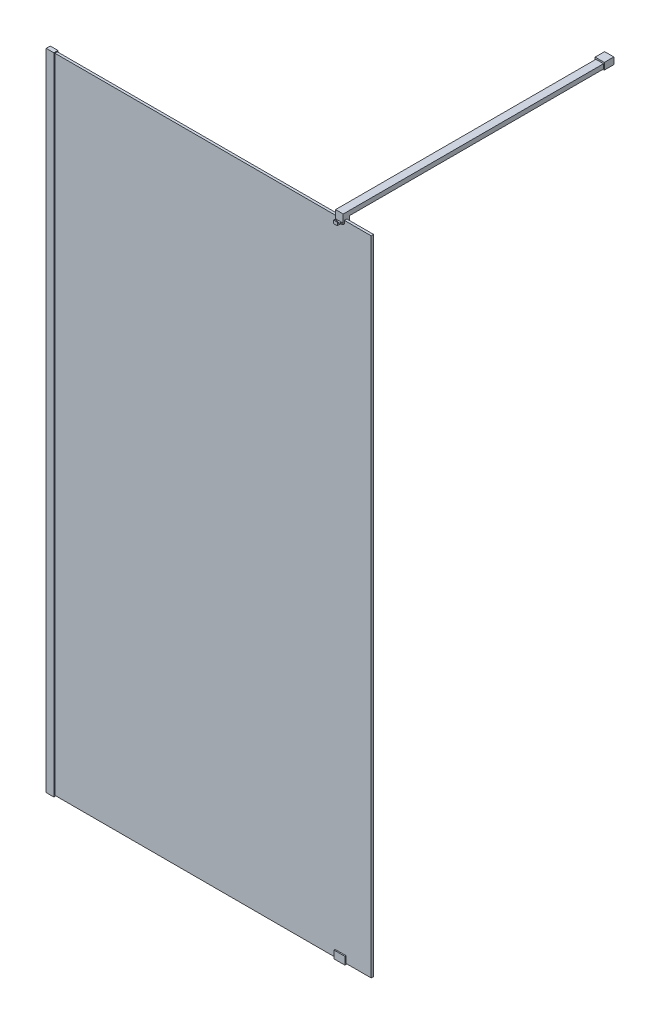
ISO-10303-21;
HEADER;
FILE_DESCRIPTION(('STEP AP214'),'2;1');
FILE_NAME('part.step','',(''),(''),'','','');
FILE_SCHEMA(('AUTOMOTIVE_DESIGN { 1 0 10303 214 1 1 1 1 }'));
ENDSEC;
DATA;
#1=APPLICATION_CONTEXT('core data for automotive mechanical design processes');
#2=APPLICATION_PROTOCOL_DEFINITION('international standard','automotive_design',2000,#1);
#3=PRODUCT_CONTEXT('',#1,'mechanical');
#4=PRODUCT('Part','Part','',(#3));
#5=PRODUCT_RELATED_PRODUCT_CATEGORY('part','',(#4));
#6=PRODUCT_DEFINITION_FORMATION('','',#4);
#7=PRODUCT_DEFINITION_CONTEXT('part definition',#1,'design');
#8=PRODUCT_DEFINITION('design','',#6,#7);
#9=PRODUCT_DEFINITION_SHAPE('','',#8);
#10=(LENGTH_UNIT() NAMED_UNIT(*) SI_UNIT(.MILLI.,.METRE.));
#11=(NAMED_UNIT(*) PLANE_ANGLE_UNIT() SI_UNIT($,.RADIAN.));
#12=(NAMED_UNIT(*) SI_UNIT($,.STERADIAN.) SOLID_ANGLE_UNIT());
#13=UNCERTAINTY_MEASURE_WITH_UNIT(LENGTH_MEASURE(1.E-05),#10,'distance_accuracy_value','');
#14=(GEOMETRIC_REPRESENTATION_CONTEXT(3) GLOBAL_UNCERTAINTY_ASSIGNED_CONTEXT((#13)) GLOBAL_UNIT_ASSIGNED_CONTEXT((#10,
#11,#12)) REPRESENTATION_CONTEXT('',''));
#15=CARTESIAN_POINT('',(0.,0.,0.));
#16=DIRECTION('',(0.,0.,1.));
#17=DIRECTION('',(1.,0.,0.));
#18=AXIS2_PLACEMENT_3D('',#15,#16,#17);
#19=CARTESIAN_POINT('',(970.95,2090.,-19.4000000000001));
#20=DIRECTION('',(-1.,0.,0.));
#21=DIRECTION('',(0.,0.,1.));
#22=AXIS2_PLACEMENT_3D('',#19,#20,#21);
#23=PLANE('',#22);
#24=DIRECTION('',(0.,-1.,0.));
#25=VECTOR('',#24,1.);
#26=CARTESIAN_POINT('',(970.95,2090.,-850.03));
#27=LINE('',#26,#25);
#28=CARTESIAN_POINT('',(970.95,2120.,-850.03));
#29=VERTEX_POINT('',#28);
#30=CARTESIAN_POINT('',(970.95,2105.,-850.03));
#31=VERTEX_POINT('',#30);
#32=EDGE_CURVE('E61',#29,#31,#27,.T.);
#33=ORIENTED_EDGE('',*,*,#32,.F.);
#34=DIRECTION('',(0.,0.,1.));
#35=VECTOR('',#34,1.);
#36=CARTESIAN_POINT('',(970.95,2120.,0.599999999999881));
#37=LINE('',#36,#35);
#38=CARTESIAN_POINT('',(970.95,2120.,0.599999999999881));
#39=VERTEX_POINT('',#38);
#40=EDGE_CURVE('E386',#29,#39,#37,.T.);
#41=ORIENTED_EDGE('',*,*,#40,.T.);
#42=DIRECTION('',(0.,-1.,0.));
#43=VECTOR('',#42,1.);
#44=CARTESIAN_POINT('',(970.95,2094.,0.599999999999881));
#45=LINE('',#44,#43);
#46=CARTESIAN_POINT('',(970.95,2094.,0.599999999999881));
#47=VERTEX_POINT('',#46);
#48=EDGE_CURVE('E388',#39,#47,#45,.T.);
#49=ORIENTED_EDGE('',*,*,#48,.T.);
#50=DIRECTION('',(0.,1.,0.));
#51=VECTOR('',#50,1.);
#52=CARTESIAN_POINT('',(970.95,2090.,0.599999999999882));
#53=LINE('',#52,#51);
#54=CARTESIAN_POINT('',(970.95,2090.,0.599999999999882));
#55=VERTEX_POINT('',#54);
#56=EDGE_CURVE('E332',#55,#47,#53,.T.);
#57=ORIENTED_EDGE('',*,*,#56,.F.);
#58=DIRECTION('',(0.,0.,-1.));
#59=VECTOR('',#58,1.);
#60=CARTESIAN_POINT('',(970.95,2090.,-3.40000000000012));
#61=LINE('',#60,#59);
#62=CARTESIAN_POINT('',(970.95,2090.,-3.40000000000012));
#63=VERTEX_POINT('',#62);
#64=EDGE_CURVE('E362',#55,#63,#61,.T.);
#65=ORIENTED_EDGE('',*,*,#64,.T.);
#66=DIRECTION('',(0.,1.,-1.30407837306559E-13));
#67=VECTOR('',#66,1.);
#68=CARTESIAN_POINT('',(970.95,2100.,-3.40000000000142));
#69=LINE('',#68,#67);
#70=CARTESIAN_POINT('',(970.95,2100.,-3.40000000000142));
#71=VERTEX_POINT('',#70);
#72=EDGE_CURVE('E392',#63,#71,#69,.T.);
#73=ORIENTED_EDGE('',*,*,#72,.T.);
#74=DIRECTION('',(0.,0.,-1.));
#75=VECTOR('',#74,1.);
#76=CARTESIAN_POINT('',(970.95,2100.,-11.4000000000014));
#77=LINE('',#76,#75);
#78=CARTESIAN_POINT('',(970.95,2100.,-11.4000000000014));
#79=VERTEX_POINT('',#78);
#80=EDGE_CURVE('E394',#71,#79,#77,.T.);
#81=ORIENTED_EDGE('',*,*,#80,.T.);
#82=DIRECTION('',(0.,-1.,1.30451205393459E-13));
#83=VECTOR('',#82,1.);
#84=CARTESIAN_POINT('',(970.95,2090.,-11.4000000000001));
#85=LINE('',#84,#83);
#86=CARTESIAN_POINT('',(970.95,2090.,-11.4000000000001));
#87=VERTEX_POINT('',#86);
#88=EDGE_CURVE('E395',#79,#87,#85,.T.);
#89=ORIENTED_EDGE('',*,*,#88,.T.);
#90=DIRECTION('',(0.,0.,-1.));
#91=VECTOR('',#90,1.);
#92=CARTESIAN_POINT('',(970.95,2090.,-19.4000000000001));
#93=LINE('',#92,#91);
#94=CARTESIAN_POINT('',(970.95,2090.,-19.4000000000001));
#95=VERTEX_POINT('',#94);
#96=EDGE_CURVE('E283',#87,#95,#93,.T.);
#97=ORIENTED_EDGE('',*,*,#96,.T.);
#98=DIRECTION('',(0.,1.,0.));
#99=VECTOR('',#98,1.);
#100=CARTESIAN_POINT('',(970.95,2120.,-19.4000000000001));
#101=LINE('',#100,#99);
#102=CARTESIAN_POINT('',(970.95,2105.,-19.4000000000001));
#103=VERTEX_POINT('',#102);
#104=EDGE_CURVE('E249',#95,#103,#101,.T.);
#105=ORIENTED_EDGE('',*,*,#104,.T.);
#106=DIRECTION('',(0.,0.,-1.));
#107=VECTOR('',#106,1.);
#108=CARTESIAN_POINT('',(970.95,2105.,-881.03));
#109=LINE('',#108,#107);
#110=EDGE_CURVE('E248',#103,#31,#109,.T.);
#111=ORIENTED_EDGE('',*,*,#110,.T.);
#112=EDGE_LOOP('',(#33,#41,#49,#57,#65,#73,#81,#89,#97,#105,#111));
#113=FACE_BOUND('',#112,.T.);
#114=ADVANCED_FACE('F46',(#113),#23,.F.);
#115=CARTESIAN_POINT('',(945.95,2090.,-19.4000000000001));
#116=DIRECTION('',(-1.,0.,0.));
#117=DIRECTION('',(0.,0.,1.));
#118=AXIS2_PLACEMENT_3D('',#115,#116,#117);
#119=PLANE('',#118);
#120=DIRECTION('',(0.,0.,1.));
#121=VECTOR('',#120,1.);
#122=CARTESIAN_POINT('',(945.95,2120.,0.599999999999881));
#123=LINE('',#122,#121);
#124=CARTESIAN_POINT('',(945.95,2120.,-850.03));
#125=VERTEX_POINT('',#124);
#126=CARTESIAN_POINT('',(945.95,2120.,0.599999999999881));
#127=VERTEX_POINT('',#126);
#128=EDGE_CURVE('E272',#125,#127,#123,.T.);
#129=ORIENTED_EDGE('',*,*,#128,.F.);
#130=DIRECTION('',(0.,-1.,0.));
#131=VECTOR('',#130,1.);
#132=CARTESIAN_POINT('',(945.95,2090.,-850.03));
#133=LINE('',#132,#131);
#134=CARTESIAN_POINT('',(945.95,2105.,-850.03));
#135=VERTEX_POINT('',#134);
#136=EDGE_CURVE('E230',#125,#135,#133,.T.);
#137=ORIENTED_EDGE('',*,*,#136,.T.);
#138=DIRECTION('',(0.,0.,1.));
#139=VECTOR('',#138,1.);
#140=CARTESIAN_POINT('',(945.95,2105.,-881.03));
#141=LINE('',#140,#139);
#142=CARTESIAN_POINT('',(945.95,2105.,-19.4000000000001));
#143=VERTEX_POINT('',#142);
#144=EDGE_CURVE('E238',#135,#143,#141,.T.);
#145=ORIENTED_EDGE('',*,*,#144,.T.);
#146=DIRECTION('',(0.,1.,0.));
#147=VECTOR('',#146,1.);
#148=CARTESIAN_POINT('',(945.95,2120.,-19.4000000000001));
#149=LINE('',#148,#147);
#150=CARTESIAN_POINT('',(945.95,2090.,-19.4000000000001));
#151=VERTEX_POINT('',#150);
#152=EDGE_CURVE('E262',#151,#143,#149,.T.);
#153=ORIENTED_EDGE('',*,*,#152,.F.);
#154=DIRECTION('',(0.,0.,-1.));
#155=VECTOR('',#154,1.);
#156=CARTESIAN_POINT('',(945.95,2090.,-19.4000000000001));
#157=LINE('',#156,#155);
#158=CARTESIAN_POINT('',(945.95,2090.,-11.4000000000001));
#159=VERTEX_POINT('',#158);
#160=EDGE_CURVE('E296',#159,#151,#157,.T.);
#161=ORIENTED_EDGE('',*,*,#160,.F.);
#162=DIRECTION('',(0.,-1.,1.30451205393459E-13));
#163=VECTOR('',#162,1.);
#164=CARTESIAN_POINT('',(945.95,2090.,-11.4000000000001));
#165=LINE('',#164,#163);
#166=CARTESIAN_POINT('',(945.95,2100.,-11.4000000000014));
#167=VERTEX_POINT('',#166);
#168=EDGE_CURVE('E294',#167,#159,#165,.T.);
#169=ORIENTED_EDGE('',*,*,#168,.F.);
#170=DIRECTION('',(0.,0.,-1.));
#171=VECTOR('',#170,1.);
#172=CARTESIAN_POINT('',(945.95,2100.,-11.4000000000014));
#173=LINE('',#172,#171);
#174=CARTESIAN_POINT('',(945.95,2100.,-3.40000000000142));
#175=VERTEX_POINT('',#174);
#176=EDGE_CURVE('E292',#175,#167,#173,.T.);
#177=ORIENTED_EDGE('',*,*,#176,.F.);
#178=DIRECTION('',(0.,1.,-1.30407837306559E-13));
#179=VECTOR('',#178,1.);
#180=CARTESIAN_POINT('',(945.95,2100.,-3.40000000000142));
#181=LINE('',#180,#179);
#182=CARTESIAN_POINT('',(945.95,2090.,-3.40000000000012));
#183=VERTEX_POINT('',#182);
#184=EDGE_CURVE('E290',#183,#175,#181,.T.);
#185=ORIENTED_EDGE('',*,*,#184,.F.);
#186=DIRECTION('',(0.,0.,-1.));
#187=VECTOR('',#186,1.);
#188=CARTESIAN_POINT('',(945.95,2090.,-3.40000000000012));
#189=LINE('',#188,#187);
#190=CARTESIAN_POINT('',(945.95,2090.,0.599999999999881));
#191=VERTEX_POINT('',#190);
#192=EDGE_CURVE('E288',#191,#183,#189,.T.);
#193=ORIENTED_EDGE('',*,*,#192,.F.);
#194=DIRECTION('',(0.,1.,0.));
#195=VECTOR('',#194,1.);
#196=CARTESIAN_POINT('',(945.95,2090.,0.599999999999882));
#197=LINE('',#196,#195);
#198=CARTESIAN_POINT('',(945.95,2094.,0.599999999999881));
#199=VERTEX_POINT('',#198);
#200=EDGE_CURVE('E329',#191,#199,#197,.T.);
#201=ORIENTED_EDGE('',*,*,#200,.T.);
#202=DIRECTION('',(0.,-1.,0.));
#203=VECTOR('',#202,1.);
#204=CARTESIAN_POINT('',(945.95,2094.,0.599999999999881));
#205=LINE('',#204,#203);
#206=EDGE_CURVE('E274',#127,#199,#205,.T.);
#207=ORIENTED_EDGE('',*,*,#206,.F.);
#208=EDGE_LOOP('',(#129,#137,#145,#153,#161,#169,#177,#185,#193,#201,#207));
#209=FACE_BOUND('',#208,.T.);
#210=ADVANCED_FACE('F259',(#209),#119,.T.);
#211=CARTESIAN_POINT('',(970.95,2120.,0.599999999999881));
#212=DIRECTION('',(0.,-1.,0.));
#213=DIRECTION('',(0.,0.,-1.));
#214=AXIS2_PLACEMENT_3D('',#211,#212,#213);
#215=PLANE('',#214);
#216=DIRECTION('',(1.,0.,0.));
#217=VECTOR('',#216,1.);
#218=CARTESIAN_POINT('',(970.95,2120.,-850.03));
#219=LINE('',#218,#217);
#220=EDGE_CURVE('E68',#125,#29,#219,.T.);
#221=ORIENTED_EDGE('',*,*,#220,.F.);
#222=ORIENTED_EDGE('',*,*,#128,.T.);
#223=DIRECTION('',(-1.,0.,0.));
#224=VECTOR('',#223,1.);
#225=CARTESIAN_POINT('',(970.95,2120.,0.599999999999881));
#226=LINE('',#225,#224);
#227=EDGE_CURVE('E326',#39,#127,#226,.T.);
#228=ORIENTED_EDGE('',*,*,#227,.F.);
#229=ORIENTED_EDGE('',*,*,#40,.F.);
#230=EDGE_LOOP('',(#221,#222,#228,#229));
#231=FACE_BOUND('',#230,.T.);
#232=ADVANCED_FACE('F437',(#231),#215,.F.);
#233=CARTESIAN_POINT('',(945.95,2105.,-19.4000000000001));
#234=DIRECTION('',(0.,1.,0.));
#235=DIRECTION('',(0.,0.,1.));
#236=AXIS2_PLACEMENT_3D('',#233,#234,#235);
#237=PLANE('',#236);
#238=DIRECTION('',(-1.,0.,0.));
#239=VECTOR('',#238,1.);
#240=CARTESIAN_POINT('',(945.95,2105.,-850.03));
#241=LINE('',#240,#239);
#242=EDGE_CURVE('E12',#31,#135,#241,.T.);
#243=ORIENTED_EDGE('',*,*,#242,.F.);
#244=ORIENTED_EDGE('',*,*,#110,.F.);
#245=DIRECTION('',(1.,0.,0.));
#246=VECTOR('',#245,1.);
#247=CARTESIAN_POINT('',(945.95,2105.,-19.4000000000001));
#248=LINE('',#247,#246);
#249=EDGE_CURVE('E244',#143,#103,#248,.T.);
#250=ORIENTED_EDGE('',*,*,#249,.F.);
#251=ORIENTED_EDGE('',*,*,#144,.F.);
#252=EDGE_LOOP('',(#243,#244,#250,#251));
#253=FACE_BOUND('',#252,.T.);
#254=ADVANCED_FACE('F265',(#253),#237,.F.);
#255=CARTESIAN_POINT('',(970.95,2094.,9.84506801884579));
#256=DIRECTION('',(0.,-1.,0.));
#257=DIRECTION('',(0.,0.,-1.));
#258=AXIS2_PLACEMENT_3D('',#255,#256,#257);
#259=PLANE('',#258);
#260=DIRECTION('',(-0.906307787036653,0.,-0.422618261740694));
#261=VECTOR('',#260,1.);
#262=CARTESIAN_POINT('',(970.025911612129,2094.,11.8267819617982));
#263=LINE('',#262,#261);
#264=CARTESIAN_POINT('',(952.45,2094.,3.6309997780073));
#265=VERTEX_POINT('',#264);
#266=EDGE_CURVE('E365',#265,#199,#263,.T.);
#267=ORIENTED_EDGE('',*,*,#266,.F.);
#268=DIRECTION('',(0.,0.,-1.));
#269=VECTOR('',#268,1.);
#270=CARTESIAN_POINT('',(952.45,2094.,9.84506801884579));
#271=LINE('',#270,#269);
#272=CARTESIAN_POINT('',(952.45,2094.,9.84506801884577));
#273=VERTEX_POINT('',#272);
#274=EDGE_CURVE('E273',#273,#265,#271,.T.);
#275=ORIENTED_EDGE('',*,*,#274,.F.);
#276=DIRECTION('',(-1.,0.,0.));
#277=VECTOR('',#276,1.);
#278=CARTESIAN_POINT('',(970.95,2094.,9.84506801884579));
#279=LINE('',#278,#277);
#280=CARTESIAN_POINT('',(964.45,2094.,9.84506801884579));
#281=VERTEX_POINT('',#280);
#282=EDGE_CURVE('E320',#281,#273,#279,.T.);
#283=ORIENTED_EDGE('',*,*,#282,.F.);
#284=DIRECTION('',(0.,0.,1.));
#285=VECTOR('',#284,1.);
#286=CARTESIAN_POINT('',(964.45,2094.,9.84506801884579));
#287=LINE('',#286,#285);
#288=CARTESIAN_POINT('',(964.45,2094.,3.63099977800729));
#289=VERTEX_POINT('',#288);
#290=EDGE_CURVE('E379',#289,#281,#287,.T.);
#291=ORIENTED_EDGE('',*,*,#290,.F.);
#292=DIRECTION('',(-0.906307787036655,0.,0.422618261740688));
#293=VECTOR('',#292,1.);
#294=CARTESIAN_POINT('',(967.408933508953,2094.,2.25122642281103));
#295=LINE('',#294,#293);
#296=EDGE_CURVE('E364',#47,#289,#295,.T.);
#297=ORIENTED_EDGE('',*,*,#296,.F.);
#298=DIRECTION('',(-1.,0.,0.));
#299=VECTOR('',#298,1.);
#300=CARTESIAN_POINT('',(970.95,2094.,0.599999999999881));
#301=LINE('',#300,#299);
#302=EDGE_CURVE('E323',#47,#199,#301,.T.);
#303=ORIENTED_EDGE('',*,*,#302,.T.);
#304=EDGE_LOOP('',(#267,#275,#283,#291,#297,#303));
#305=FACE_BOUND('',#304,.T.);
#306=ADVANCED_FACE('F424',(#305),#259,.F.);
#307=CARTESIAN_POINT('',(970.95,2100.,10.3700000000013));
#308=DIRECTION('',(0.,-0.087155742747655,0.996194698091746));
#309=DIRECTION('',(0.,-0.996194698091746,-0.087155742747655));
#310=AXIS2_PLACEMENT_3D('',#307,#308,#309);
#311=PLANE('',#310);
#312=DIRECTION('',(0.,-0.996194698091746,-0.087155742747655));
#313=VECTOR('',#312,1.);
#314=CARTESIAN_POINT('',(952.45,2100.,10.3700000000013));
#315=LINE('',#314,#313);
#316=CARTESIAN_POINT('',(952.45,2100.,10.3700000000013));
#317=VERTEX_POINT('',#316);
#318=EDGE_CURVE('E276',#317,#273,#315,.T.);
#319=ORIENTED_EDGE('',*,*,#318,.F.);
#320=DIRECTION('',(-1.,0.,0.));
#321=VECTOR('',#320,1.);
#322=CARTESIAN_POINT('',(970.95,2100.,10.3700000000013));
#323=LINE('',#322,#321);
#324=CARTESIAN_POINT('',(964.45,2100.,10.3700000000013));
#325=VERTEX_POINT('',#324);
#326=EDGE_CURVE('E317',#325,#317,#323,.T.);
#327=ORIENTED_EDGE('',*,*,#326,.F.);
#328=DIRECTION('',(0.,0.996194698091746,0.087155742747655));
#329=VECTOR('',#328,1.);
#330=CARTESIAN_POINT('',(964.45,2100.,10.3700000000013));
#331=LINE('',#330,#329);
#332=EDGE_CURVE('E376',#281,#325,#331,.T.);
#333=ORIENTED_EDGE('',*,*,#332,.F.);
#334=ORIENTED_EDGE('',*,*,#282,.T.);
#335=EDGE_LOOP('',(#319,#327,#333,#334));
#336=FACE_BOUND('',#335,.T.);
#337=ADVANCED_FACE('F428',(#336),#311,.F.);
#338=CARTESIAN_POINT('',(970.95,2100.,13.3700000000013));
#339=DIRECTION('',(0.,-1.,1.48029736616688E-13));
#340=DIRECTION('',(0.,-1.48029736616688E-13,-1.));
#341=AXIS2_PLACEMENT_3D('',#338,#339,#340);
#342=PLANE('',#341);
#343=DIRECTION('',(0.,-1.48029736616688E-13,-1.));
#344=VECTOR('',#343,1.);
#345=CARTESIAN_POINT('',(952.45,2100.,13.3700000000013));
#346=LINE('',#345,#344);
#347=CARTESIAN_POINT('',(952.45,2100.,13.3700000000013));
#348=VERTEX_POINT('',#347);
#349=EDGE_CURVE('E382',#348,#317,#346,.T.);
#350=ORIENTED_EDGE('',*,*,#349,.F.);
#351=DIRECTION('',(-1.,0.,0.));
#352=VECTOR('',#351,1.);
#353=CARTESIAN_POINT('',(970.95,2100.,13.3700000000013));
#354=LINE('',#353,#352);
#355=CARTESIAN_POINT('',(964.45,2100.,13.3700000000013));
#356=VERTEX_POINT('',#355);
#357=EDGE_CURVE('E314',#356,#348,#354,.T.);
#358=ORIENTED_EDGE('',*,*,#357,.F.);
#359=DIRECTION('',(0.,1.48029736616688E-13,1.));
#360=VECTOR('',#359,1.);
#361=CARTESIAN_POINT('',(964.45,2100.,13.3700000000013));
#362=LINE('',#361,#360);
#363=EDGE_CURVE('E368',#325,#356,#362,.T.);
#364=ORIENTED_EDGE('',*,*,#363,.F.);
#365=ORIENTED_EDGE('',*,*,#326,.T.);
#366=EDGE_LOOP('',(#350,#358,#364,#365));
#367=FACE_BOUND('',#366,.T.);
#368=ADVANCED_FACE('F431',(#367),#342,.F.);
#369=CARTESIAN_POINT('',(970.95,2090.,13.3700000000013));
#370=DIRECTION('',(0.,0.,-1.));
#371=DIRECTION('',(0.,1.,0.));
#372=AXIS2_PLACEMENT_3D('',#369,#370,#371);
#373=PLANE('',#372);
#374=ORIENTED_EDGE('',*,*,#357,.T.);
#375=DIRECTION('',(0.,-1.,0.));
#376=VECTOR('',#375,1.);
#377=CARTESIAN_POINT('',(952.45,7694.31257189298,13.3700000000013));
#378=LINE('',#377,#376);
#379=CARTESIAN_POINT('',(952.45,2090.,13.3700000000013));
#380=VERTEX_POINT('',#379);
#381=EDGE_CURVE('E345',#348,#380,#378,.T.);
#382=ORIENTED_EDGE('',*,*,#381,.T.);
#383=DIRECTION('',(-1.,0.,0.));
#384=VECTOR('',#383,1.);
#385=CARTESIAN_POINT('',(970.95,2090.,13.3700000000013));
#386=LINE('',#385,#384);
#387=CARTESIAN_POINT('',(964.45,2090.,13.3700000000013));
#388=VERTEX_POINT('',#387);
#389=EDGE_CURVE('E311',#388,#380,#386,.T.);
#390=ORIENTED_EDGE('',*,*,#389,.F.);
#391=DIRECTION('',(0.,-1.,0.));
#392=VECTOR('',#391,1.);
#393=CARTESIAN_POINT('',(964.45,7694.31257189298,13.3700000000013));
#394=LINE('',#393,#392);
#395=EDGE_CURVE('E355',#356,#388,#394,.T.);
#396=ORIENTED_EDGE('',*,*,#395,.F.);
#397=EDGE_LOOP('',(#374,#382,#390,#396));
#398=FACE_BOUND('',#397,.T.);
#399=ADVANCED_FACE('F353',(#398),#373,.F.);
#400=CARTESIAN_POINT('',(970.95,2090.,-3.40000000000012));
#401=DIRECTION('',(0.,1.,0.));
#402=DIRECTION('',(0.,0.,1.));
#403=AXIS2_PLACEMENT_3D('',#400,#401,#402);
#404=PLANE('',#403);
#405=DIRECTION('',(0.906307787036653,0.,0.422618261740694));
#406=VECTOR('',#405,1.);
#407=CARTESIAN_POINT('',(964.952756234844,2090.,9.46113075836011));
#408=LINE('',#407,#406);
#409=CARTESIAN_POINT('',(952.45,2090.,3.6309997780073));
#410=VERTEX_POINT('',#409);
#411=EDGE_CURVE('E370',#191,#410,#408,.T.);
#412=ORIENTED_EDGE('',*,*,#411,.F.);
#413=ORIENTED_EDGE('',*,*,#192,.T.);
#414=DIRECTION('',(-1.,0.,0.));
#415=VECTOR('',#414,1.);
#416=CARTESIAN_POINT('',(970.95,2090.,-3.40000000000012));
#417=LINE('',#416,#415);
#418=EDGE_CURVE('E308',#63,#183,#417,.T.);
#419=ORIENTED_EDGE('',*,*,#418,.F.);
#420=ORIENTED_EDGE('',*,*,#64,.F.);
#421=DIRECTION('',(0.906307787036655,0.,-0.422618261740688));
#422=VECTOR('',#421,1.);
#423=CARTESIAN_POINT('',(972.482088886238,2090.,-0.114424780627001));
#424=LINE('',#423,#422);
#425=CARTESIAN_POINT('',(964.45,2090.,3.6309997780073));
#426=VERTEX_POINT('',#425);
#427=EDGE_CURVE('E360',#426,#55,#424,.T.);
#428=ORIENTED_EDGE('',*,*,#427,.F.);
#429=DIRECTION('',(0.,0.,-1.));
#430=VECTOR('',#429,1.);
#431=CARTESIAN_POINT('',(964.45,2090.,-3.40000000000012));
#432=LINE('',#431,#430);
#433=EDGE_CURVE('E334',#388,#426,#432,.T.);
#434=ORIENTED_EDGE('',*,*,#433,.F.);
#435=ORIENTED_EDGE('',*,*,#389,.T.);
#436=DIRECTION('',(0.,0.,1.));
#437=VECTOR('',#436,1.);
#438=CARTESIAN_POINT('',(952.45,2090.,-3.40000000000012));
#439=LINE('',#438,#437);
#440=EDGE_CURVE('E54',#410,#380,#439,.T.);
#441=ORIENTED_EDGE('',*,*,#440,.F.);
#442=EDGE_LOOP('',(#412,#413,#419,#420,#428,#434,#435,#441));
#443=FACE_BOUND('',#442,.T.);
#444=ADVANCED_FACE('F357',(#443),#404,.F.);
#445=CARTESIAN_POINT('',(970.95,2120.,-19.4000000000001));
#446=DIRECTION('',(0.,0.,1.));
#447=DIRECTION('',(0.,-1.,0.));
#448=AXIS2_PLACEMENT_3D('',#445,#446,#447);
#449=PLANE('',#448);
#450=ORIENTED_EDGE('',*,*,#152,.T.);
#451=ORIENTED_EDGE('',*,*,#249,.T.);
#452=ORIENTED_EDGE('',*,*,#104,.F.);
#453=DIRECTION('',(-1.,0.,0.));
#454=VECTOR('',#453,1.);
#455=CARTESIAN_POINT('',(970.95,2090.,-19.4000000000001));
#456=LINE('',#455,#454);
#457=EDGE_CURVE('E271',#95,#151,#456,.T.);
#458=ORIENTED_EDGE('',*,*,#457,.T.);
#459=EDGE_LOOP('',(#450,#451,#452,#458));
#460=FACE_BOUND('',#459,.T.);
#461=ADVANCED_FACE('F48',(#460),#449,.F.);
#462=CARTESIAN_POINT('',(970.95,2094.,0.599999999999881));
#463=DIRECTION('',(0.,0.,-1.));
#464=DIRECTION('',(0.,1.,0.));
#465=AXIS2_PLACEMENT_3D('',#462,#463,#464);
#466=PLANE('',#465);
#467=ORIENTED_EDGE('',*,*,#206,.T.);
#468=ORIENTED_EDGE('',*,*,#302,.F.);
#469=ORIENTED_EDGE('',*,*,#48,.F.);
#470=ORIENTED_EDGE('',*,*,#227,.T.);
#471=EDGE_LOOP('',(#467,#468,#469,#470));
#472=FACE_BOUND('',#471,.T.);
#473=ADVANCED_FACE('F435',(#472),#466,.F.);
#474=CARTESIAN_POINT('',(970.95,2100.,-3.40000000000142));
#475=DIRECTION('',(0.,1.30407837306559E-13,1.));
#476=DIRECTION('',(0.,-1.,1.30407837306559E-13));
#477=AXIS2_PLACEMENT_3D('',#474,#475,#476);
#478=PLANE('',#477);
#479=ORIENTED_EDGE('',*,*,#184,.T.);
#480=DIRECTION('',(-1.,0.,0.));
#481=VECTOR('',#480,1.);
#482=CARTESIAN_POINT('',(970.95,2100.,-3.40000000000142));
#483=LINE('',#482,#481);
#484=EDGE_CURVE('E305',#71,#175,#483,.T.);
#485=ORIENTED_EDGE('',*,*,#484,.F.);
#486=ORIENTED_EDGE('',*,*,#72,.F.);
#487=ORIENTED_EDGE('',*,*,#418,.T.);
#488=EDGE_LOOP('',(#479,#485,#486,#487));
#489=FACE_BOUND('',#488,.T.);
#490=ADVANCED_FACE('F413',(#489),#478,.F.);
#491=CARTESIAN_POINT('',(970.95,2100.,-11.4000000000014));
#492=DIRECTION('',(0.,1.,0.));
#493=DIRECTION('',(0.,0.,1.));
#494=AXIS2_PLACEMENT_3D('',#491,#492,#493);
#495=PLANE('',#494);
#496=ORIENTED_EDGE('',*,*,#176,.T.);
#497=DIRECTION('',(-1.,0.,0.));
#498=VECTOR('',#497,1.);
#499=CARTESIAN_POINT('',(970.95,2100.,-11.4000000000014));
#500=LINE('',#499,#498);
#501=EDGE_CURVE('E302',#79,#167,#500,.T.);
#502=ORIENTED_EDGE('',*,*,#501,.F.);
#503=ORIENTED_EDGE('',*,*,#80,.F.);
#504=ORIENTED_EDGE('',*,*,#484,.T.);
#505=EDGE_LOOP('',(#496,#502,#503,#504));
#506=FACE_BOUND('',#505,.T.);
#507=ADVANCED_FACE('F409',(#506),#495,.F.);
#508=CARTESIAN_POINT('',(970.95,2090.,-11.4000000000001));
#509=DIRECTION('',(0.,-1.30451205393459E-13,-1.));
#510=DIRECTION('',(0.,1.,-1.30451205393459E-13));
#511=AXIS2_PLACEMENT_3D('',#508,#509,#510);
#512=PLANE('',#511);
#513=ORIENTED_EDGE('',*,*,#168,.T.);
#514=DIRECTION('',(-1.,0.,0.));
#515=VECTOR('',#514,1.);
#516=CARTESIAN_POINT('',(970.95,2090.,-11.4000000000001));
#517=LINE('',#516,#515);
#518=EDGE_CURVE('E299',#87,#159,#517,.T.);
#519=ORIENTED_EDGE('',*,*,#518,.F.);
#520=ORIENTED_EDGE('',*,*,#88,.F.);
#521=ORIENTED_EDGE('',*,*,#501,.T.);
#522=EDGE_LOOP('',(#513,#519,#520,#521));
#523=FACE_BOUND('',#522,.T.);
#524=ADVANCED_FACE('F405',(#523),#512,.F.);
#525=CARTESIAN_POINT('',(970.95,2090.,-19.4000000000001));
#526=DIRECTION('',(0.,1.,0.));
#527=DIRECTION('',(0.,0.,1.));
#528=AXIS2_PLACEMENT_3D('',#525,#526,#527);
#529=PLANE('',#528);
#530=ORIENTED_EDGE('',*,*,#160,.T.);
#531=ORIENTED_EDGE('',*,*,#457,.F.);
#532=ORIENTED_EDGE('',*,*,#96,.F.);
#533=ORIENTED_EDGE('',*,*,#518,.T.);
#534=EDGE_LOOP('',(#530,#531,#532,#533));
#535=FACE_BOUND('',#534,.T.);
#536=ADVANCED_FACE('F400',(#535),#529,.F.);
#537=CARTESIAN_POINT('',(945.95,7694.31257189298,0.599999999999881));
#538=DIRECTION('',(-0.422618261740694,0.,0.906307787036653));
#539=DIRECTION('',(0.906307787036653,0.,0.422618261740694));
#540=AXIS2_PLACEMENT_3D('',#537,#538,#539);
#541=PLANE('',#540);
#542=DIRECTION('',(0.,-1.,0.));
#543=VECTOR('',#542,1.);
#544=CARTESIAN_POINT('',(952.45,7694.31257189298,3.6309997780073));
#545=LINE('',#544,#543);
#546=EDGE_CURVE('E348',#265,#410,#545,.T.);
#547=ORIENTED_EDGE('',*,*,#546,.F.);
#548=ORIENTED_EDGE('',*,*,#266,.T.);
#549=ORIENTED_EDGE('',*,*,#200,.F.);
#550=ORIENTED_EDGE('',*,*,#411,.T.);
#551=EDGE_LOOP('',(#547,#548,#549,#550));
#552=FACE_BOUND('',#551,.T.);
#553=ADVANCED_FACE('F432',(#552),#541,.T.);
#554=CARTESIAN_POINT('',(952.45,7694.31257189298,3.6309997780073));
#555=DIRECTION('',(-1.,0.,0.));
#556=DIRECTION('',(0.,0.,1.));
#557=AXIS2_PLACEMENT_3D('',#554,#555,#556);
#558=PLANE('',#557);
#559=ORIENTED_EDGE('',*,*,#318,.T.);
#560=ORIENTED_EDGE('',*,*,#274,.T.);
#561=ORIENTED_EDGE('',*,*,#546,.T.);
#562=ORIENTED_EDGE('',*,*,#440,.T.);
#563=ORIENTED_EDGE('',*,*,#381,.F.);
#564=ORIENTED_EDGE('',*,*,#349,.T.);
#565=EDGE_LOOP('',(#559,#560,#561,#562,#563,#564));
#566=FACE_BOUND('',#565,.T.);
#567=ADVANCED_FACE('F344',(#566),#558,.T.);
#568=CARTESIAN_POINT('',(964.45,7694.31257189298,3.6309997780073));
#569=DIRECTION('',(1.,0.,0.));
#570=DIRECTION('',(0.,0.,-1.));
#571=AXIS2_PLACEMENT_3D('',#568,#569,#570);
#572=PLANE('',#571);
#573=DIRECTION('',(0.,-1.,0.));
#574=VECTOR('',#573,1.);
#575=CARTESIAN_POINT('',(964.45,7694.31257189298,3.6309997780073));
#576=LINE('',#575,#574);
#577=EDGE_CURVE('E241',#289,#426,#576,.T.);
#578=ORIENTED_EDGE('',*,*,#577,.F.);
#579=ORIENTED_EDGE('',*,*,#290,.T.);
#580=ORIENTED_EDGE('',*,*,#332,.T.);
#581=ORIENTED_EDGE('',*,*,#363,.T.);
#582=ORIENTED_EDGE('',*,*,#395,.T.);
#583=ORIENTED_EDGE('',*,*,#433,.T.);
#584=EDGE_LOOP('',(#578,#579,#580,#581,#582,#583));
#585=FACE_BOUND('',#584,.T.);
#586=ADVANCED_FACE('F420',(#585),#572,.T.);
#587=CARTESIAN_POINT('',(970.95,7694.31257189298,0.599999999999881));
#588=DIRECTION('',(0.422618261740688,0.,0.906307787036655));
#589=DIRECTION('',(0.906307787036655,0.,-0.422618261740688));
#590=AXIS2_PLACEMENT_3D('',#587,#588,#589);
#591=PLANE('',#590);
#592=ORIENTED_EDGE('',*,*,#56,.T.);
#593=ORIENTED_EDGE('',*,*,#296,.T.);
#594=ORIENTED_EDGE('',*,*,#577,.T.);
#595=ORIENTED_EDGE('',*,*,#427,.T.);
#596=EDGE_LOOP('',(#592,#593,#594,#595));
#597=FACE_BOUND('',#596,.T.);
#598=ADVANCED_FACE('F418',(#597),#591,.T.);
#599=CARTESIAN_POINT('',(943.449999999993,2103.,-850.03));
#600=DIRECTION('',(0.,0.,-1.));
#601=DIRECTION('',(-1.,0.,0.));
#602=AXIS2_PLACEMENT_3D('',#599,#600,#601);
#603=PLANE('',#602);
#604=DIRECTION('',(0.,1.,0.));
#605=VECTOR('',#604,1.);
#606=CARTESIAN_POINT('',(943.449999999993,2125.,-850.03));
#607=LINE('',#606,#605);
#608=CARTESIAN_POINT('',(943.449999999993,2103.,-850.03));
#609=VERTEX_POINT('',#608);
#610=CARTESIAN_POINT('',(943.449999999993,2125.,-850.03));
#611=VERTEX_POINT('',#610);
#612=EDGE_CURVE('E209',#609,#611,#607,.T.);
#613=ORIENTED_EDGE('',*,*,#612,.F.);
#614=DIRECTION('',(-1.,0.,0.));
#615=VECTOR('',#614,1.);
#616=CARTESIAN_POINT('',(973.449999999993,2103.,-850.03));
#617=LINE('',#616,#615);
#618=CARTESIAN_POINT('',(973.449999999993,2103.,-850.03));
#619=VERTEX_POINT('',#618);
#620=EDGE_CURVE('E201',#619,#609,#617,.T.);
#621=ORIENTED_EDGE('',*,*,#620,.F.);
#622=DIRECTION('',(0.,-1.,0.));
#623=VECTOR('',#622,1.);
#624=CARTESIAN_POINT('',(973.449999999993,2125.,-850.03));
#625=LINE('',#624,#623);
#626=CARTESIAN_POINT('',(973.449999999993,2125.,-850.03));
#627=VERTEX_POINT('',#626);
#628=EDGE_CURVE('E212',#627,#619,#625,.T.);
#629=ORIENTED_EDGE('',*,*,#628,.F.);
#630=DIRECTION('',(1.,0.,0.));
#631=VECTOR('',#630,1.);
#632=CARTESIAN_POINT('',(973.449999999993,2125.,-850.03));
#633=LINE('',#632,#631);
#634=EDGE_CURVE('E193',#611,#627,#633,.T.);
#635=ORIENTED_EDGE('',*,*,#634,.F.);
#636=EDGE_LOOP('',(#613,#621,#629,#635));
#637=FACE_BOUND('',#636,.T.);
#638=ORIENTED_EDGE('',*,*,#136,.F.);
#639=ORIENTED_EDGE('',*,*,#220,.T.);
#640=ORIENTED_EDGE('',*,*,#32,.T.);
#641=ORIENTED_EDGE('',*,*,#242,.T.);
#642=EDGE_LOOP('',(#638,#639,#640,#641));
#643=FACE_BOUND('',#642,.T.);
#644=ADVANCED_FACE('F206',(#637,#643),#603,.F.);
#645=CARTESIAN_POINT('',(943.449999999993,2125.,-850.03));
#646=DIRECTION('',(-1.,0.,0.));
#647=DIRECTION('',(0.,-1.,0.));
#648=AXIS2_PLACEMENT_3D('',#645,#646,#647);
#649=PLANE('',#648);
#650=DIRECTION('',(0.,1.,0.));
#651=VECTOR('',#650,1.);
#652=CARTESIAN_POINT('',(943.449999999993,2125.,-881.03));
#653=LINE('',#652,#651);
#654=CARTESIAN_POINT('',(943.449999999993,2103.,-881.03));
#655=VERTEX_POINT('',#654);
#656=CARTESIAN_POINT('',(943.449999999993,2125.,-881.03));
#657=VERTEX_POINT('',#656);
#658=EDGE_CURVE('E224',#655,#657,#653,.T.);
#659=ORIENTED_EDGE('',*,*,#658,.F.);
#660=DIRECTION('',(0.,0.,-1.));
#661=VECTOR('',#660,1.);
#662=CARTESIAN_POINT('',(943.449999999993,2103.,-850.03));
#663=LINE('',#662,#661);
#664=EDGE_CURVE('E215',#609,#655,#663,.T.);
#665=ORIENTED_EDGE('',*,*,#664,.F.);
#666=ORIENTED_EDGE('',*,*,#612,.T.);
#667=DIRECTION('',(0.,0.,-1.));
#668=VECTOR('',#667,1.);
#669=CARTESIAN_POINT('',(943.449999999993,2125.,-850.03));
#670=LINE('',#669,#668);
#671=EDGE_CURVE('E190',#611,#657,#670,.T.);
#672=ORIENTED_EDGE('',*,*,#671,.T.);
#673=EDGE_LOOP('',(#659,#665,#666,#672));
#674=FACE_BOUND('',#673,.T.);
#675=ADVANCED_FACE('F214',(#674),#649,.T.);
#676=CARTESIAN_POINT('',(973.449999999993,2103.,-850.03));
#677=DIRECTION('',(0.,-1.,0.));
#678=DIRECTION('',(0.,0.,-1.));
#679=AXIS2_PLACEMENT_3D('',#676,#677,#678);
#680=PLANE('',#679);
#681=DIRECTION('',(-1.,0.,0.));
#682=VECTOR('',#681,1.);
#683=CARTESIAN_POINT('',(973.449999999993,2103.,-881.03));
#684=LINE('',#683,#682);
#685=CARTESIAN_POINT('',(973.449999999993,2103.,-881.03));
#686=VERTEX_POINT('',#685);
#687=EDGE_CURVE('E216',#686,#655,#684,.T.);
#688=ORIENTED_EDGE('',*,*,#687,.F.);
#689=DIRECTION('',(0.,0.,-1.));
#690=VECTOR('',#689,1.);
#691=CARTESIAN_POINT('',(973.449999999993,2103.,-850.03));
#692=LINE('',#691,#690);
#693=EDGE_CURVE('E231',#619,#686,#692,.T.);
#694=ORIENTED_EDGE('',*,*,#693,.F.);
#695=ORIENTED_EDGE('',*,*,#620,.T.);
#696=ORIENTED_EDGE('',*,*,#664,.T.);
#697=EDGE_LOOP('',(#688,#694,#695,#696));
#698=FACE_BOUND('',#697,.T.);
#699=ADVANCED_FACE('F444',(#698),#680,.T.);
#700=CARTESIAN_POINT('',(973.449999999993,2125.,-850.03));
#701=DIRECTION('',(1.,0.,0.));
#702=DIRECTION('',(0.,0.,-1.));
#703=AXIS2_PLACEMENT_3D('',#700,#701,#702);
#704=PLANE('',#703);
#705=DIRECTION('',(0.,-1.,0.));
#706=VECTOR('',#705,1.);
#707=CARTESIAN_POINT('',(973.449999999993,2125.,-881.03));
#708=LINE('',#707,#706);
#709=CARTESIAN_POINT('',(973.449999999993,2125.,-881.03));
#710=VERTEX_POINT('',#709);
#711=EDGE_CURVE('E219',#710,#686,#708,.T.);
#712=ORIENTED_EDGE('',*,*,#711,.F.);
#713=DIRECTION('',(0.,0.,-1.));
#714=VECTOR('',#713,1.);
#715=CARTESIAN_POINT('',(973.449999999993,2125.,-850.03));
#716=LINE('',#715,#714);
#717=EDGE_CURVE('E200',#627,#710,#716,.T.);
#718=ORIENTED_EDGE('',*,*,#717,.F.);
#719=ORIENTED_EDGE('',*,*,#628,.T.);
#720=ORIENTED_EDGE('',*,*,#693,.T.);
#721=EDGE_LOOP('',(#712,#718,#719,#720));
#722=FACE_BOUND('',#721,.T.);
#723=ADVANCED_FACE('F612',(#722),#704,.T.);
#724=CARTESIAN_POINT('',(973.449999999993,2125.,-850.03));
#725=DIRECTION('',(0.,1.,0.));
#726=DIRECTION('',(0.,0.,1.));
#727=AXIS2_PLACEMENT_3D('',#724,#725,#726);
#728=PLANE('',#727);
#729=DIRECTION('',(1.,0.,0.));
#730=VECTOR('',#729,1.);
#731=CARTESIAN_POINT('',(973.449999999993,2125.,-881.03));
#732=LINE('',#731,#730);
#733=EDGE_CURVE('E195',#657,#710,#732,.T.);
#734=ORIENTED_EDGE('',*,*,#733,.F.);
#735=ORIENTED_EDGE('',*,*,#671,.F.);
#736=ORIENTED_EDGE('',*,*,#634,.T.);
#737=ORIENTED_EDGE('',*,*,#717,.T.);
#738=EDGE_LOOP('',(#734,#735,#736,#737));
#739=FACE_BOUND('',#738,.T.);
#740=ADVANCED_FACE('F192',(#739),#728,.T.);
#741=CARTESIAN_POINT('',(945.95,2105.,-881.03));
#742=DIRECTION('',(0.,0.,-1.));
#743=DIRECTION('',(-1.,0.,0.));
#744=AXIS2_PLACEMENT_3D('',#741,#742,#743);
#745=PLANE('',#744);
#746=ORIENTED_EDGE('',*,*,#658,.T.);
#747=ORIENTED_EDGE('',*,*,#733,.T.);
#748=ORIENTED_EDGE('',*,*,#711,.T.);
#749=ORIENTED_EDGE('',*,*,#687,.T.);
#750=EDGE_LOOP('',(#746,#747,#748,#749));
#751=FACE_BOUND('',#750,.T.);
#752=ADVANCED_FACE('F485',(#751),#745,.T.);
#753=CLOSED_SHELL('',(#114,#210,#232,#254,#306,#337,#368,#399,#444,#461,#473,#490,#507,#524,
#536,#553,#567,#586,#598,#644,#675,#699,#723,#740,#752));
#754=MANIFOLD_SOLID_BREP('B2',#753);
#755=CARTESIAN_POINT('',(975.95,22.,-11.4000000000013));
#756=DIRECTION('',(0.,0.,-1.));
#757=DIRECTION('',(0.,1.,0.));
#758=AXIS2_PLACEMENT_3D('',#755,#756,#757);
#759=PLANE('',#758);
#760=DIRECTION('',(0.,-1.,0.));
#761=VECTOR('',#760,1.);
#762=CARTESIAN_POINT('',(940.95,22.,-11.4000000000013));
#763=LINE('',#762,#761);
#764=CARTESIAN_POINT('',(940.95,22.,-11.4000000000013));
#765=VERTEX_POINT('',#764);
#766=CARTESIAN_POINT('',(940.95,0.,-11.4));
#767=VERTEX_POINT('',#766);
#768=EDGE_CURVE('E765',#765,#767,#763,.T.);
#769=ORIENTED_EDGE('',*,*,#768,.T.);
#770=DIRECTION('',(-1.,0.,0.));
#771=VECTOR('',#770,1.);
#772=CARTESIAN_POINT('',(975.95,0.,-11.4));
#773=LINE('',#772,#771);
#774=CARTESIAN_POINT('',(975.95,0.,-11.4));
#775=VERTEX_POINT('',#774);
#776=EDGE_CURVE('E44',#775,#767,#773,.T.);
#777=ORIENTED_EDGE('',*,*,#776,.F.);
#778=DIRECTION('',(0.,-1.,0.));
#779=VECTOR('',#778,1.);
#780=CARTESIAN_POINT('',(975.95,22.,-11.4000000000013));
#781=LINE('',#780,#779);
#782=CARTESIAN_POINT('',(975.95,22.,-11.4000000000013));
#783=VERTEX_POINT('',#782);
#784=EDGE_CURVE('E779',#783,#775,#781,.T.);
#785=ORIENTED_EDGE('',*,*,#784,.F.);
#786=DIRECTION('',(-1.,0.,0.));
#787=VECTOR('',#786,1.);
#788=CARTESIAN_POINT('',(975.95,22.,-11.4000000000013));
#789=LINE('',#788,#787);
#790=EDGE_CURVE('E761',#783,#765,#789,.T.);
#791=ORIENTED_EDGE('',*,*,#790,.T.);
#792=EDGE_LOOP('',(#769,#777,#785,#791));
#793=FACE_BOUND('',#792,.T.);
#794=ADVANCED_FACE('F669',(#793),#759,.F.);
#795=CARTESIAN_POINT('',(975.95,0.,-11.4));
#796=DIRECTION('',(0.,-1.,0.));
#797=DIRECTION('',(0.,0.,-1.));
#798=AXIS2_PLACEMENT_3D('',#795,#796,#797);
#799=PLANE('',#798);
#800=DIRECTION('',(0.,0.,1.));
#801=VECTOR('',#800,1.);
#802=CARTESIAN_POINT('',(940.95,0.,-11.4));
#803=LINE('',#802,#801);
#804=CARTESIAN_POINT('',(940.95,0.,-3.4));
#805=VERTEX_POINT('',#804);
#806=EDGE_CURVE('E768',#767,#805,#803,.T.);
#807=ORIENTED_EDGE('',*,*,#806,.T.);
#808=DIRECTION('',(-1.,0.,0.));
#809=VECTOR('',#808,1.);
#810=CARTESIAN_POINT('',(975.95,0.,-3.4));
#811=LINE('',#810,#809);
#812=CARTESIAN_POINT('',(975.95,0.,-3.4));
#813=VERTEX_POINT('',#812);
#814=EDGE_CURVE('E677',#813,#805,#811,.T.);
#815=ORIENTED_EDGE('',*,*,#814,.F.);
#816=DIRECTION('',(0.,0.,1.));
#817=VECTOR('',#816,1.);
#818=CARTESIAN_POINT('',(975.95,0.,-11.4));
#819=LINE('',#818,#817);
#820=EDGE_CURVE('E728',#775,#813,#819,.T.);
#821=ORIENTED_EDGE('',*,*,#820,.F.);
#822=ORIENTED_EDGE('',*,*,#776,.T.);
#823=EDGE_LOOP('',(#807,#815,#821,#822));
#824=FACE_BOUND('',#823,.T.);
#825=ADVANCED_FACE('F814',(#824),#799,.F.);
#826=CARTESIAN_POINT('',(975.95,0.,-3.4));
#827=DIRECTION('',(0.,0.,1.));
#828=DIRECTION('',(0.,-1.,0.));
#829=AXIS2_PLACEMENT_3D('',#826,#827,#828);
#830=PLANE('',#829);
#831=DIRECTION('',(0.,1.,0.));
#832=VECTOR('',#831,1.);
#833=CARTESIAN_POINT('',(940.95,0.,-3.4));
#834=LINE('',#833,#832);
#835=CARTESIAN_POINT('',(940.95,21.9999999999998,-3.4000000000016));
#836=VERTEX_POINT('',#835);
#837=EDGE_CURVE('E770',#805,#836,#834,.T.);
#838=ORIENTED_EDGE('',*,*,#837,.T.);
#839=DIRECTION('',(-1.,0.,0.));
#840=VECTOR('',#839,1.);
#841=CARTESIAN_POINT('',(975.95,21.9999999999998,-3.4000000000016));
#842=LINE('',#841,#840);
#843=CARTESIAN_POINT('',(975.95,21.9999999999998,-3.4000000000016));
#844=VERTEX_POINT('',#843);
#845=EDGE_CURVE('E786',#844,#836,#842,.T.);
#846=ORIENTED_EDGE('',*,*,#845,.F.);
#847=DIRECTION('',(0.,1.,0.));
#848=VECTOR('',#847,1.);
#849=CARTESIAN_POINT('',(975.95,0.,-3.4));
#850=LINE('',#849,#848);
#851=EDGE_CURVE('E794',#813,#844,#850,.T.);
#852=ORIENTED_EDGE('',*,*,#851,.F.);
#853=ORIENTED_EDGE('',*,*,#814,.T.);
#854=EDGE_LOOP('',(#838,#846,#852,#853));
#855=FACE_BOUND('',#854,.T.);
#856=ADVANCED_FACE('F792',(#855),#830,.F.);
#857=CARTESIAN_POINT('',(975.95,22.,0.349999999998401));
#858=DIRECTION('',(0.,-1.,0.));
#859=DIRECTION('',(0.,0.,-1.));
#860=AXIS2_PLACEMENT_3D('',#857,#858,#859);
#861=PLANE('',#860);
#862=DIRECTION('',(0.,0.,1.));
#863=VECTOR('',#862,1.);
#864=CARTESIAN_POINT('',(940.95,22.,0.349999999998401));
#865=LINE('',#864,#863);
#866=CARTESIAN_POINT('',(940.95,22.,0.349999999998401));
#867=VERTEX_POINT('',#866);
#868=EDGE_CURVE('E772',#836,#867,#865,.T.);
#869=ORIENTED_EDGE('',*,*,#868,.T.);
#870=DIRECTION('',(-1.,0.,0.));
#871=VECTOR('',#870,1.);
#872=CARTESIAN_POINT('',(975.95,22.,0.349999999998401));
#873=LINE('',#872,#871);
#874=CARTESIAN_POINT('',(975.95,22.,0.349999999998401));
#875=VERTEX_POINT('',#874);
#876=EDGE_CURVE('E783',#875,#867,#873,.T.);
#877=ORIENTED_EDGE('',*,*,#876,.F.);
#878=DIRECTION('',(0.,0.,1.));
#879=VECTOR('',#878,1.);
#880=CARTESIAN_POINT('',(975.95,22.,0.349999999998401));
#881=LINE('',#880,#879);
#882=EDGE_CURVE('E806',#844,#875,#881,.T.);
#883=ORIENTED_EDGE('',*,*,#882,.F.);
#884=ORIENTED_EDGE('',*,*,#845,.T.);
#885=EDGE_LOOP('',(#869,#877,#883,#884));
#886=FACE_BOUND('',#885,.T.);
#887=ADVANCED_FACE('F802',(#886),#861,.F.);
#888=CARTESIAN_POINT('',(975.95,-3.,0.349999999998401));
#889=DIRECTION('',(0.,0.,-1.));
#890=DIRECTION('',(-1.,0.,0.));
#891=AXIS2_PLACEMENT_3D('',#888,#889,#890);
#892=PLANE('',#891);
#893=DIRECTION('',(0.,-1.,0.));
#894=VECTOR('',#893,1.);
#895=CARTESIAN_POINT('',(940.95,-3.,0.349999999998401));
#896=LINE('',#895,#894);
#897=CARTESIAN_POINT('',(940.95,-3.,0.349999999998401));
#898=VERTEX_POINT('',#897);
#899=EDGE_CURVE('E774',#867,#898,#896,.T.);
#900=ORIENTED_EDGE('',*,*,#899,.T.);
#901=DIRECTION('',(-1.,0.,0.));
#902=VECTOR('',#901,1.);
#903=CARTESIAN_POINT('',(975.95,-3.,0.349999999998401));
#904=LINE('',#903,#902);
#905=CARTESIAN_POINT('',(975.95,-3.,0.349999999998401));
#906=VERTEX_POINT('',#905);
#907=EDGE_CURVE('E756',#906,#898,#904,.T.);
#908=ORIENTED_EDGE('',*,*,#907,.F.);
#909=DIRECTION('',(0.,-1.,0.));
#910=VECTOR('',#909,1.);
#911=CARTESIAN_POINT('',(975.95,-3.,0.349999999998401));
#912=LINE('',#911,#910);
#913=EDGE_CURVE('E747',#875,#906,#912,.T.);
#914=ORIENTED_EDGE('',*,*,#913,.F.);
#915=ORIENTED_EDGE('',*,*,#876,.T.);
#916=EDGE_LOOP('',(#900,#908,#914,#915));
#917=FACE_BOUND('',#916,.T.);
#918=ADVANCED_FACE('F805',(#917),#892,.F.);
#919=CARTESIAN_POINT('',(975.95,-3.,-15.7500000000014));
#920=DIRECTION('',(0.,1.,0.));
#921=DIRECTION('',(0.,0.,1.));
#922=AXIS2_PLACEMENT_3D('',#919,#920,#921);
#923=PLANE('',#922);
#924=DIRECTION('',(0.,0.,-1.));
#925=VECTOR('',#924,1.);
#926=CARTESIAN_POINT('',(940.95,-3.,-15.7500000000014));
#927=LINE('',#926,#925);
#928=CARTESIAN_POINT('',(940.95,-3.,-15.7500000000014));
#929=VERTEX_POINT('',#928);
#930=EDGE_CURVE('E755',#898,#929,#927,.T.);
#931=ORIENTED_EDGE('',*,*,#930,.T.);
#932=DIRECTION('',(-1.,0.,0.));
#933=VECTOR('',#932,1.);
#934=CARTESIAN_POINT('',(975.95,-3.,-15.7500000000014));
#935=LINE('',#934,#933);
#936=CARTESIAN_POINT('',(975.95,-3.,-15.7500000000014));
#937=VERTEX_POINT('',#936);
#938=EDGE_CURVE('E752',#937,#929,#935,.T.);
#939=ORIENTED_EDGE('',*,*,#938,.F.);
#940=DIRECTION('',(0.,0.,-1.));
#941=VECTOR('',#940,1.);
#942=CARTESIAN_POINT('',(975.95,-3.,-15.7500000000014));
#943=LINE('',#942,#941);
#944=EDGE_CURVE('E741',#906,#937,#943,.T.);
#945=ORIENTED_EDGE('',*,*,#944,.F.);
#946=ORIENTED_EDGE('',*,*,#907,.T.);
#947=EDGE_LOOP('',(#931,#939,#945,#946));
#948=FACE_BOUND('',#947,.T.);
#949=ADVANCED_FACE('F753',(#948),#923,.F.);
#950=CARTESIAN_POINT('',(975.95,22.,-15.7500000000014));
#951=DIRECTION('',(0.,0.,1.));
#952=DIRECTION('',(0.,-1.,0.));
#953=AXIS2_PLACEMENT_3D('',#950,#951,#952);
#954=PLANE('',#953);
#955=DIRECTION('',(0.,1.,0.));
#956=VECTOR('',#955,1.);
#957=CARTESIAN_POINT('',(940.95,22.,-15.7500000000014));
#958=LINE('',#957,#956);
#959=CARTESIAN_POINT('',(940.95,22.,-15.7500000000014));
#960=VERTEX_POINT('',#959);
#961=EDGE_CURVE('E714',#929,#960,#958,.T.);
#962=ORIENTED_EDGE('',*,*,#961,.T.);
#963=DIRECTION('',(-1.,0.,0.));
#964=VECTOR('',#963,1.);
#965=CARTESIAN_POINT('',(975.95,22.,-15.7500000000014));
#966=LINE('',#965,#964);
#967=CARTESIAN_POINT('',(975.95,22.,-15.7500000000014));
#968=VERTEX_POINT('',#967);
#969=EDGE_CURVE('E757',#968,#960,#966,.T.);
#970=ORIENTED_EDGE('',*,*,#969,.F.);
#971=DIRECTION('',(0.,1.,0.));
#972=VECTOR('',#971,1.);
#973=CARTESIAN_POINT('',(975.95,22.,-15.7500000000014));
#974=LINE('',#973,#972);
#975=EDGE_CURVE('E745',#937,#968,#974,.T.);
#976=ORIENTED_EDGE('',*,*,#975,.F.);
#977=ORIENTED_EDGE('',*,*,#938,.T.);
#978=EDGE_LOOP('',(#962,#970,#976,#977));
#979=FACE_BOUND('',#978,.T.);
#980=ADVANCED_FACE('F759',(#979),#954,.F.);
#981=CARTESIAN_POINT('',(975.95,22.,-11.4000000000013));
#982=DIRECTION('',(0.,-1.,0.));
#983=DIRECTION('',(0.,0.,-1.));
#984=AXIS2_PLACEMENT_3D('',#981,#982,#983);
#985=PLANE('',#984);
#986=DIRECTION('',(0.,0.,1.));
#987=VECTOR('',#986,1.);
#988=CARTESIAN_POINT('',(940.95,22.,-11.4000000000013));
#989=LINE('',#988,#987);
#990=EDGE_CURVE('E720',#960,#765,#989,.T.);
#991=ORIENTED_EDGE('',*,*,#990,.T.);
#992=ORIENTED_EDGE('',*,*,#790,.F.);
#993=DIRECTION('',(0.,0.,1.));
#994=VECTOR('',#993,1.);
#995=CARTESIAN_POINT('',(975.95,22.,-11.4000000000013));
#996=LINE('',#995,#994);
#997=EDGE_CURVE('E685',#968,#783,#996,.T.);
#998=ORIENTED_EDGE('',*,*,#997,.F.);
#999=ORIENTED_EDGE('',*,*,#969,.T.);
#1000=EDGE_LOOP('',(#991,#992,#998,#999));
#1001=FACE_BOUND('',#1000,.T.);
#1002=ADVANCED_FACE('F830',(#1001),#985,.F.);
#1003=CARTESIAN_POINT('',(975.95,0.,-11.4));
#1004=DIRECTION('',(-1.,0.,0.));
#1005=DIRECTION('',(0.,0.,1.));
#1006=AXIS2_PLACEMENT_3D('',#1003,#1004,#1005);
#1007=PLANE('',#1006);
#1008=ORIENTED_EDGE('',*,*,#784,.T.);
#1009=ORIENTED_EDGE('',*,*,#820,.T.);
#1010=ORIENTED_EDGE('',*,*,#851,.T.);
#1011=ORIENTED_EDGE('',*,*,#882,.T.);
#1012=ORIENTED_EDGE('',*,*,#913,.T.);
#1013=ORIENTED_EDGE('',*,*,#944,.T.);
#1014=ORIENTED_EDGE('',*,*,#975,.T.);
#1015=ORIENTED_EDGE('',*,*,#997,.T.);
#1016=EDGE_LOOP('',(#1008,#1009,#1010,#1011,#1012,#1013,#1014,#1015));
#1017=FACE_BOUND('',#1016,.T.);
#1018=ADVANCED_FACE('F743',(#1017),#1007,.F.);
#1019=CARTESIAN_POINT('',(940.95,0.,-11.4));
#1020=DIRECTION('',(-1.,0.,0.));
#1021=DIRECTION('',(0.,0.,1.));
#1022=AXIS2_PLACEMENT_3D('',#1019,#1020,#1021);
#1023=PLANE('',#1022);
#1024=ORIENTED_EDGE('',*,*,#768,.F.);
#1025=ORIENTED_EDGE('',*,*,#990,.F.);
#1026=ORIENTED_EDGE('',*,*,#961,.F.);
#1027=ORIENTED_EDGE('',*,*,#930,.F.);
#1028=ORIENTED_EDGE('',*,*,#899,.F.);
#1029=ORIENTED_EDGE('',*,*,#868,.F.);
#1030=ORIENTED_EDGE('',*,*,#837,.F.);
#1031=ORIENTED_EDGE('',*,*,#806,.F.);
#1032=EDGE_LOOP('',(#1024,#1025,#1026,#1027,#1028,#1029,#1030,#1031));
#1033=FACE_BOUND('',#1032,.T.);
#1034=ADVANCED_FACE('F798',(#1033),#1023,.T.);
#1035=CLOSED_SHELL('',(#794,#825,#856,#887,#918,#949,#980,#1002,#1018,#1034));
#1036=MANIFOLD_SOLID_BREP('B6',#1035);
#1037=CARTESIAN_POINT('',(11.45,2100.,-3.4));
#1038=DIRECTION('',(-1.,0.,0.));
#1039=DIRECTION('',(0.,0.,1.));
#1040=AXIS2_PLACEMENT_3D('',#1037,#1038,#1039);
#1041=PLANE('',#1040);
#1042=DIRECTION('',(0.,0.,-1.));
#1043=VECTOR('',#1042,1.);
#1044=CARTESIAN_POINT('',(11.45,0.,-3.4));
#1045=LINE('',#1044,#1043);
#1046=CARTESIAN_POINT('',(11.45,0.,-3.4));
#1047=VERTEX_POINT('',#1046);
#1048=CARTESIAN_POINT('',(11.45,0.,-11.4));
#1049=VERTEX_POINT('',#1048);
#1050=EDGE_CURVE('E970',#1047,#1049,#1045,.T.);
#1051=ORIENTED_EDGE('',*,*,#1050,.F.);
#1052=DIRECTION('',(0.,-1.,0.));
#1053=VECTOR('',#1052,1.);
#1054=CARTESIAN_POINT('',(11.45,2100.,-3.4));
#1055=LINE('',#1054,#1053);
#1056=CARTESIAN_POINT('',(11.45,2100.,-3.4));
#1057=VERTEX_POINT('',#1056);
#1058=EDGE_CURVE('E667',#1057,#1047,#1055,.T.);
#1059=ORIENTED_EDGE('',*,*,#1058,.F.);
#1060=DIRECTION('',(0.,0.,-1.));
#1061=VECTOR('',#1060,1.);
#1062=CARTESIAN_POINT('',(11.45,2100.,-3.4));
#1063=LINE('',#1062,#1061);
#1064=CARTESIAN_POINT('',(11.45,2100.,-11.4));
#1065=VERTEX_POINT('',#1064);
#1066=EDGE_CURVE('E964',#1057,#1065,#1063,.T.);
#1067=ORIENTED_EDGE('',*,*,#1066,.T.);
#1068=DIRECTION('',(0.,-1.,0.));
#1069=VECTOR('',#1068,1.);
#1070=CARTESIAN_POINT('',(11.45,2100.,-11.4));
#1071=LINE('',#1070,#1069);
#1072=EDGE_CURVE('E909',#1065,#1049,#1071,.T.);
#1073=ORIENTED_EDGE('',*,*,#1072,.T.);
#1074=EDGE_LOOP('',(#1051,#1059,#1067,#1073));
#1075=FACE_BOUND('',#1074,.T.);
#1076=ADVANCED_FACE('F906',(#1075),#1041,.T.);
#1077=CARTESIAN_POINT('',(11.45,2100.,-3.4));
#1078=DIRECTION('',(0.,0.,1.));
#1079=DIRECTION('',(1.,0.,0.));
#1080=AXIS2_PLACEMENT_3D('',#1077,#1078,#1079);
#1081=PLANE('',#1080);
#1082=DIRECTION('',(-1.,0.,0.));
#1083=VECTOR('',#1082,1.);
#1084=CARTESIAN_POINT('',(11.45,0.,-3.4));
#1085=LINE('',#1084,#1083);
#1086=CARTESIAN_POINT('',(1058.45,0.,-3.4));
#1087=VERTEX_POINT('',#1086);
#1088=EDGE_CURVE('E966',#1087,#1047,#1085,.T.);
#1089=ORIENTED_EDGE('',*,*,#1088,.F.);
#1090=DIRECTION('',(0.,-1.,0.));
#1091=VECTOR('',#1090,1.);
#1092=CARTESIAN_POINT('',(1058.45,2100.,-3.4));
#1093=LINE('',#1092,#1091);
#1094=CARTESIAN_POINT('',(1058.45,2100.,-3.4));
#1095=VERTEX_POINT('',#1094);
#1096=EDGE_CURVE('E915',#1095,#1087,#1093,.T.);
#1097=ORIENTED_EDGE('',*,*,#1096,.F.);
#1098=DIRECTION('',(-1.,0.,0.));
#1099=VECTOR('',#1098,1.);
#1100=CARTESIAN_POINT('',(11.45,2100.,-3.4));
#1101=LINE('',#1100,#1099);
#1102=EDGE_CURVE('E961',#1095,#1057,#1101,.T.);
#1103=ORIENTED_EDGE('',*,*,#1102,.T.);
#1104=ORIENTED_EDGE('',*,*,#1058,.T.);
#1105=EDGE_LOOP('',(#1089,#1097,#1103,#1104));
#1106=FACE_BOUND('',#1105,.T.);
#1107=ADVANCED_FACE('F980',(#1106),#1081,.T.);
#1108=CARTESIAN_POINT('',(1058.45,2100.,-3.4));
#1109=DIRECTION('',(1.,0.,0.));
#1110=DIRECTION('',(0.,0.,-1.));
#1111=AXIS2_PLACEMENT_3D('',#1108,#1109,#1110);
#1112=PLANE('',#1111);
#1113=DIRECTION('',(0.,0.,1.));
#1114=VECTOR('',#1113,1.);
#1115=CARTESIAN_POINT('',(1058.45,0.,-3.4));
#1116=LINE('',#1115,#1114);
#1117=CARTESIAN_POINT('',(1058.45,0.,-11.4));
#1118=VERTEX_POINT('',#1117);
#1119=EDGE_CURVE('E956',#1118,#1087,#1116,.T.);
#1120=ORIENTED_EDGE('',*,*,#1119,.F.);
#1121=DIRECTION('',(0.,-1.,0.));
#1122=VECTOR('',#1121,1.);
#1123=CARTESIAN_POINT('',(1058.45,2100.,-11.4));
#1124=LINE('',#1123,#1122);
#1125=CARTESIAN_POINT('',(1058.45,2100.,-11.4));
#1126=VERTEX_POINT('',#1125);
#1127=EDGE_CURVE('E951',#1126,#1118,#1124,.T.);
#1128=ORIENTED_EDGE('',*,*,#1127,.F.);
#1129=DIRECTION('',(0.,0.,1.));
#1130=VECTOR('',#1129,1.);
#1131=CARTESIAN_POINT('',(1058.45,2100.,-3.4));
#1132=LINE('',#1131,#1130);
#1133=EDGE_CURVE('E954',#1126,#1095,#1132,.T.);
#1134=ORIENTED_EDGE('',*,*,#1133,.T.);
#1135=ORIENTED_EDGE('',*,*,#1096,.T.);
#1136=EDGE_LOOP('',(#1120,#1128,#1134,#1135));
#1137=FACE_BOUND('',#1136,.T.);
#1138=ADVANCED_FACE('F953',(#1137),#1112,.T.);
#1139=CARTESIAN_POINT('',(11.45,2100.,-11.4));
#1140=DIRECTION('',(0.,0.,-1.));
#1141=DIRECTION('',(-1.,0.,0.));
#1142=AXIS2_PLACEMENT_3D('',#1139,#1140,#1141);
#1143=PLANE('',#1142);
#1144=DIRECTION('',(1.,0.,0.));
#1145=VECTOR('',#1144,1.);
#1146=CARTESIAN_POINT('',(11.45,0.,-11.4));
#1147=LINE('',#1146,#1145);
#1148=EDGE_CURVE('E973',#1049,#1118,#1147,.T.);
#1149=ORIENTED_EDGE('',*,*,#1148,.F.);
#1150=ORIENTED_EDGE('',*,*,#1072,.F.);
#1151=DIRECTION('',(1.,0.,0.));
#1152=VECTOR('',#1151,1.);
#1153=CARTESIAN_POINT('',(11.45,2100.,-11.4));
#1154=LINE('',#1153,#1152);
#1155=EDGE_CURVE('E960',#1065,#1126,#1154,.T.);
#1156=ORIENTED_EDGE('',*,*,#1155,.T.);
#1157=ORIENTED_EDGE('',*,*,#1127,.T.);
#1158=EDGE_LOOP('',(#1149,#1150,#1156,#1157));
#1159=FACE_BOUND('',#1158,.T.);
#1160=ADVANCED_FACE('F963',(#1159),#1143,.T.);
#1161=CARTESIAN_POINT('',(11.45,2100.,-11.4));
#1162=DIRECTION('',(0.,-1.,0.));
#1163=DIRECTION('',(0.,0.,-1.));
#1164=AXIS2_PLACEMENT_3D('',#1161,#1162,#1163);
#1165=PLANE('',#1164);
#1166=ORIENTED_EDGE('',*,*,#1066,.F.);
#1167=ORIENTED_EDGE('',*,*,#1102,.F.);
#1168=ORIENTED_EDGE('',*,*,#1133,.F.);
#1169=ORIENTED_EDGE('',*,*,#1155,.F.);
#1170=EDGE_LOOP('',(#1166,#1167,#1168,#1169));
#1171=FACE_BOUND('',#1170,.T.);
#1172=ADVANCED_FACE('F959',(#1171),#1165,.F.);
#1173=CARTESIAN_POINT('',(11.45,0.,-11.4));
#1174=DIRECTION('',(0.,-1.,0.));
#1175=DIRECTION('',(0.,0.,-1.));
#1176=AXIS2_PLACEMENT_3D('',#1173,#1174,#1175);
#1177=PLANE('',#1176);
#1178=ORIENTED_EDGE('',*,*,#1050,.T.);
#1179=ORIENTED_EDGE('',*,*,#1148,.T.);
#1180=ORIENTED_EDGE('',*,*,#1119,.T.);
#1181=ORIENTED_EDGE('',*,*,#1088,.T.);
#1182=EDGE_LOOP('',(#1178,#1179,#1180,#1181));
#1183=FACE_BOUND('',#1182,.T.);
#1184=ADVANCED_FACE('F979',(#1183),#1177,.T.);
#1185=CLOSED_SHELL('',(#1076,#1107,#1138,#1160,#1172,#1184));
#1186=MANIFOLD_SOLID_BREP('B38',#1185);
#1187=CARTESIAN_POINT('',(0.,2100.,-13.3));
#1188=DIRECTION('',(0.,0.,1.));
#1189=DIRECTION('',(1.,0.,0.));
#1190=AXIS2_PLACEMENT_3D('',#1187,#1188,#1189);
#1191=PLANE('',#1190);
#1192=DIRECTION('',(0.,-1.,0.));
#1193=VECTOR('',#1192,1.);
#1194=CARTESIAN_POINT('',(25.,2100.,-13.3));
#1195=LINE('',#1194,#1193);
#1196=CARTESIAN_POINT('',(25.,2103.,-13.3));
#1197=VERTEX_POINT('',#1196);
#1198=CARTESIAN_POINT('',(25.,-3.,-13.3));
#1199=VERTEX_POINT('',#1198);
#1200=EDGE_CURVE('E1104',#1197,#1199,#1195,.T.);
#1201=ORIENTED_EDGE('',*,*,#1200,.T.);
#1202=DIRECTION('',(1.,0.,0.));
#1203=VECTOR('',#1202,1.);
#1204=CARTESIAN_POINT('',(25.,-3.,-13.3));
#1205=LINE('',#1204,#1203);
#1206=CARTESIAN_POINT('',(0.,-3.,-13.3));
#1207=VERTEX_POINT('',#1206);
#1208=EDGE_CURVE('E1103',#1207,#1199,#1205,.T.);
#1209=ORIENTED_EDGE('',*,*,#1208,.F.);
#1210=DIRECTION('',(0.,-1.,0.));
#1211=VECTOR('',#1210,1.);
#1212=CARTESIAN_POINT('',(0.,2100.,-13.3));
#1213=LINE('',#1212,#1211);
#1214=CARTESIAN_POINT('',(0.,2103.,-13.3));
#1215=VERTEX_POINT('',#1214);
#1216=EDGE_CURVE('E904',#1215,#1207,#1213,.T.);
#1217=ORIENTED_EDGE('',*,*,#1216,.F.);
#1218=DIRECTION('',(-1.,0.,0.));
#1219=VECTOR('',#1218,1.);
#1220=CARTESIAN_POINT('',(25.,2103.,-13.3));
#1221=LINE('',#1220,#1219);
#1222=EDGE_CURVE('E1131',#1197,#1215,#1221,.T.);
#1223=ORIENTED_EDGE('',*,*,#1222,.F.);
#1224=EDGE_LOOP('',(#1201,#1209,#1217,#1223));
#1225=FACE_BOUND('',#1224,.T.);
#1226=ADVANCED_FACE('F1030',(#1225),#1191,.F.);
#1227=CARTESIAN_POINT('',(0.,2100.,0.));
#1228=DIRECTION('',(1.,0.,0.));
#1229=DIRECTION('',(0.,0.,-1.));
#1230=AXIS2_PLACEMENT_3D('',#1227,#1228,#1229);
#1231=PLANE('',#1230);
#1232=ORIENTED_EDGE('',*,*,#1216,.T.);
#1233=DIRECTION('',(0.,0.,-1.));
#1234=VECTOR('',#1233,1.);
#1235=CARTESIAN_POINT('',(0.,-3.,-13.3));
#1236=LINE('',#1235,#1234);
#1237=CARTESIAN_POINT('',(0.,-3.,0.));
#1238=VERTEX_POINT('',#1237);
#1239=EDGE_CURVE('E1096',#1238,#1207,#1236,.T.);
#1240=ORIENTED_EDGE('',*,*,#1239,.F.);
#1241=DIRECTION('',(0.,-1.,0.));
#1242=VECTOR('',#1241,1.);
#1243=CARTESIAN_POINT('',(0.,2100.,0.));
#1244=LINE('',#1243,#1242);
#1245=CARTESIAN_POINT('',(0.,2103.,0.));
#1246=VERTEX_POINT('',#1245);
#1247=EDGE_CURVE('E1040',#1246,#1238,#1244,.T.);
#1248=ORIENTED_EDGE('',*,*,#1247,.F.);
#1249=DIRECTION('',(0.,0.,1.));
#1250=VECTOR('',#1249,1.);
#1251=CARTESIAN_POINT('',(0.,2103.,-13.3));
#1252=LINE('',#1251,#1250);
#1253=EDGE_CURVE('E1098',#1215,#1246,#1252,.T.);
#1254=ORIENTED_EDGE('',*,*,#1253,.F.);
#1255=EDGE_LOOP('',(#1232,#1240,#1248,#1254));
#1256=FACE_BOUND('',#1255,.T.);
#1257=ADVANCED_FACE('F1094',(#1256),#1231,.F.);
#1258=CARTESIAN_POINT('',(25.,2100.,0.));
#1259=DIRECTION('',(0.,0.,-1.));
#1260=DIRECTION('',(-1.,0.,0.));
#1261=AXIS2_PLACEMENT_3D('',#1258,#1259,#1260);
#1262=PLANE('',#1261);
#1263=ORIENTED_EDGE('',*,*,#1247,.T.);
#1264=DIRECTION('',(-1.,0.,0.));
#1265=VECTOR('',#1264,1.);
#1266=CARTESIAN_POINT('',(0.,-3.,0.));
#1267=LINE('',#1266,#1265);
#1268=CARTESIAN_POINT('',(25.,-3.,0.));
#1269=VERTEX_POINT('',#1268);
#1270=EDGE_CURVE('E1113',#1269,#1238,#1267,.T.);
#1271=ORIENTED_EDGE('',*,*,#1270,.F.);
#1272=DIRECTION('',(0.,-1.,0.));
#1273=VECTOR('',#1272,1.);
#1274=CARTESIAN_POINT('',(25.,2100.,0.));
#1275=LINE('',#1274,#1273);
#1276=CARTESIAN_POINT('',(25.,2103.,0.));
#1277=VERTEX_POINT('',#1276);
#1278=EDGE_CURVE('E1155',#1277,#1269,#1275,.T.);
#1279=ORIENTED_EDGE('',*,*,#1278,.F.);
#1280=DIRECTION('',(1.,0.,0.));
#1281=VECTOR('',#1280,1.);
#1282=CARTESIAN_POINT('',(0.,2103.,0.));
#1283=LINE('',#1282,#1281);
#1284=EDGE_CURVE('E1125',#1246,#1277,#1283,.T.);
#1285=ORIENTED_EDGE('',*,*,#1284,.F.);
#1286=EDGE_LOOP('',(#1263,#1271,#1279,#1285));
#1287=FACE_BOUND('',#1286,.T.);
#1288=ADVANCED_FACE('F1204',(#1287),#1262,.F.);
#1289=CARTESIAN_POINT('',(11.45,2100.,-3.4));
#1290=DIRECTION('',(0.,0.,1.));
#1291=DIRECTION('',(1.,0.,0.));
#1292=AXIS2_PLACEMENT_3D('',#1289,#1290,#1291);
#1293=PLANE('',#1292);
#1294=DIRECTION('',(-1.,0.,0.));
#1295=VECTOR('',#1294,1.);
#1296=CARTESIAN_POINT('',(11.45,0.,-3.4));
#1297=LINE('',#1296,#1295);
#1298=CARTESIAN_POINT('',(25.,0.,-3.4));
#1299=VERTEX_POINT('',#1298);
#1300=CARTESIAN_POINT('',(11.45,0.,-3.4));
#1301=VERTEX_POINT('',#1300);
#1302=EDGE_CURVE('E1133',#1299,#1301,#1297,.T.);
#1303=ORIENTED_EDGE('',*,*,#1302,.T.);
#1304=DIRECTION('',(0.,-1.,0.));
#1305=VECTOR('',#1304,1.);
#1306=CARTESIAN_POINT('',(11.45,2100.,-3.4));
#1307=LINE('',#1306,#1305);
#1308=CARTESIAN_POINT('',(11.45,2100.,-3.4));
#1309=VERTEX_POINT('',#1308);
#1310=EDGE_CURVE('E1156',#1309,#1301,#1307,.T.);
#1311=ORIENTED_EDGE('',*,*,#1310,.F.);
#1312=DIRECTION('',(-1.,0.,0.));
#1313=VECTOR('',#1312,1.);
#1314=CARTESIAN_POINT('',(11.45,2100.,-3.4));
#1315=LINE('',#1314,#1313);
#1316=CARTESIAN_POINT('',(25.,2100.,-3.4));
#1317=VERTEX_POINT('',#1316);
#1318=EDGE_CURVE('E1142',#1317,#1309,#1315,.T.);
#1319=ORIENTED_EDGE('',*,*,#1318,.F.);
#1320=DIRECTION('',(0.,-1.,0.));
#1321=VECTOR('',#1320,1.);
#1322=CARTESIAN_POINT('',(25.,2100.,-3.4));
#1323=LINE('',#1322,#1321);
#1324=EDGE_CURVE('E1152',#1317,#1299,#1323,.T.);
#1325=ORIENTED_EDGE('',*,*,#1324,.T.);
#1326=EDGE_LOOP('',(#1303,#1311,#1319,#1325));
#1327=FACE_BOUND('',#1326,.T.);
#1328=ADVANCED_FACE('F1185',(#1327),#1293,.F.);
#1329=CARTESIAN_POINT('',(11.45,2100.,-11.4));
#1330=DIRECTION('',(-1.,0.,0.));
#1331=DIRECTION('',(0.,0.,1.));
#1332=AXIS2_PLACEMENT_3D('',#1329,#1330,#1331);
#1333=PLANE('',#1332);
#1334=DIRECTION('',(0.,0.,-1.));
#1335=VECTOR('',#1334,1.);
#1336=CARTESIAN_POINT('',(11.45,0.,-11.4));
#1337=LINE('',#1336,#1335);
#1338=CARTESIAN_POINT('',(11.45,0.,-11.4));
#1339=VERTEX_POINT('',#1338);
#1340=EDGE_CURVE('E1145',#1301,#1339,#1337,.T.);
#1341=ORIENTED_EDGE('',*,*,#1340,.T.);
#1342=DIRECTION('',(0.,-1.,0.));
#1343=VECTOR('',#1342,1.);
#1344=CARTESIAN_POINT('',(11.45,2100.,-11.4));
#1345=LINE('',#1344,#1343);
#1346=CARTESIAN_POINT('',(11.45,2100.,-11.4));
#1347=VERTEX_POINT('',#1346);
#1348=EDGE_CURVE('E1048',#1347,#1339,#1345,.T.);
#1349=ORIENTED_EDGE('',*,*,#1348,.F.);
#1350=DIRECTION('',(0.,0.,-1.));
#1351=VECTOR('',#1350,1.);
#1352=CARTESIAN_POINT('',(11.45,2100.,-11.4));
#1353=LINE('',#1352,#1351);
#1354=EDGE_CURVE('E1138',#1309,#1347,#1353,.T.);
#1355=ORIENTED_EDGE('',*,*,#1354,.F.);
#1356=ORIENTED_EDGE('',*,*,#1310,.T.);
#1357=EDGE_LOOP('',(#1341,#1349,#1355,#1356));
#1358=FACE_BOUND('',#1357,.T.);
#1359=ADVANCED_FACE('F1183',(#1358),#1333,.F.);
#1360=CARTESIAN_POINT('',(25.,2100.,-11.4));
#1361=DIRECTION('',(0.,0.,-1.));
#1362=DIRECTION('',(-1.,0.,0.));
#1363=AXIS2_PLACEMENT_3D('',#1360,#1361,#1362);
#1364=PLANE('',#1363);
#1365=DIRECTION('',(1.,0.,0.));
#1366=VECTOR('',#1365,1.);
#1367=CARTESIAN_POINT('',(25.,0.,-11.4));
#1368=LINE('',#1367,#1366);
#1369=CARTESIAN_POINT('',(25.,0.,-11.4));
#1370=VERTEX_POINT('',#1369);
#1371=EDGE_CURVE('E1033',#1339,#1370,#1368,.T.);
#1372=ORIENTED_EDGE('',*,*,#1371,.T.);
#1373=DIRECTION('',(0.,-1.,0.));
#1374=VECTOR('',#1373,1.);
#1375=CARTESIAN_POINT('',(25.,2100.,-11.4));
#1376=LINE('',#1375,#1374);
#1377=CARTESIAN_POINT('',(25.,2100.,-11.4));
#1378=VERTEX_POINT('',#1377);
#1379=EDGE_CURVE('E1172',#1378,#1370,#1376,.T.);
#1380=ORIENTED_EDGE('',*,*,#1379,.F.);
#1381=DIRECTION('',(1.,0.,0.));
#1382=VECTOR('',#1381,1.);
#1383=CARTESIAN_POINT('',(25.,2100.,-11.4));
#1384=LINE('',#1383,#1382);
#1385=EDGE_CURVE('E1141',#1347,#1378,#1384,.T.);
#1386=ORIENTED_EDGE('',*,*,#1385,.F.);
#1387=ORIENTED_EDGE('',*,*,#1348,.T.);
#1388=EDGE_LOOP('',(#1372,#1380,#1386,#1387));
#1389=FACE_BOUND('',#1388,.T.);
#1390=ADVANCED_FACE('F1171',(#1389),#1364,.F.);
#1391=CARTESIAN_POINT('',(25.,2100.,-13.3));
#1392=DIRECTION('',(-1.,0.,0.));
#1393=DIRECTION('',(0.,0.,1.));
#1394=AXIS2_PLACEMENT_3D('',#1391,#1392,#1393);
#1395=PLANE('',#1394);
#1396=DIRECTION('',(0.,0.,1.));
#1397=VECTOR('',#1396,1.);
#1398=CARTESIAN_POINT('',(25.,-3.,0.));
#1399=LINE('',#1398,#1397);
#1400=EDGE_CURVE('E1108',#1199,#1269,#1399,.T.);
#1401=ORIENTED_EDGE('',*,*,#1400,.F.);
#1402=ORIENTED_EDGE('',*,*,#1200,.F.);
#1403=DIRECTION('',(0.,0.,-1.));
#1404=VECTOR('',#1403,1.);
#1405=CARTESIAN_POINT('',(25.,2103.,0.));
#1406=LINE('',#1405,#1404);
#1407=EDGE_CURVE('E1128',#1277,#1197,#1406,.T.);
#1408=ORIENTED_EDGE('',*,*,#1407,.F.);
#1409=ORIENTED_EDGE('',*,*,#1278,.T.);
#1410=EDGE_LOOP('',(#1401,#1402,#1408,#1409));
#1411=FACE_BOUND('',#1410,.T.);
#1412=ORIENTED_EDGE('',*,*,#1379,.T.);
#1413=DIRECTION('',(0.,0.,1.));
#1414=VECTOR('',#1413,1.);
#1415=CARTESIAN_POINT('',(25.,0.,0.));
#1416=LINE('',#1415,#1414);
#1417=EDGE_CURVE('E1114',#1370,#1299,#1416,.T.);
#1418=ORIENTED_EDGE('',*,*,#1417,.T.);
#1419=ORIENTED_EDGE('',*,*,#1324,.F.);
#1420=DIRECTION('',(0.,0.,-1.));
#1421=VECTOR('',#1420,1.);
#1422=CARTESIAN_POINT('',(25.,2100.,0.));
#1423=LINE('',#1422,#1421);
#1424=EDGE_CURVE('E1121',#1317,#1378,#1423,.T.);
#1425=ORIENTED_EDGE('',*,*,#1424,.T.);
#1426=EDGE_LOOP('',(#1412,#1418,#1419,#1425));
#1427=FACE_BOUND('',#1426,.T.);
#1428=ADVANCED_FACE('F1175',(#1411,#1427),#1395,.F.);
#1429=CARTESIAN_POINT('',(0.,2100.,0.));
#1430=DIRECTION('',(0.,1.,0.));
#1431=DIRECTION('',(0.,0.,1.));
#1432=AXIS2_PLACEMENT_3D('',#1429,#1430,#1431);
#1433=PLANE('',#1432);
#1434=ORIENTED_EDGE('',*,*,#1424,.F.);
#1435=ORIENTED_EDGE('',*,*,#1318,.T.);
#1436=ORIENTED_EDGE('',*,*,#1354,.T.);
#1437=ORIENTED_EDGE('',*,*,#1385,.T.);
#1438=EDGE_LOOP('',(#1434,#1435,#1436,#1437));
#1439=FACE_BOUND('',#1438,.T.);
#1440=ADVANCED_FACE('F1187',(#1439),#1433,.F.);
#1441=CARTESIAN_POINT('',(0.,2103.,0.));
#1442=DIRECTION('',(0.,1.,0.));
#1443=DIRECTION('',(0.,0.,1.));
#1444=AXIS2_PLACEMENT_3D('',#1441,#1442,#1443);
#1445=PLANE('',#1444);
#1446=ORIENTED_EDGE('',*,*,#1253,.T.);
#1447=ORIENTED_EDGE('',*,*,#1284,.T.);
#1448=ORIENTED_EDGE('',*,*,#1407,.T.);
#1449=ORIENTED_EDGE('',*,*,#1222,.T.);
#1450=EDGE_LOOP('',(#1446,#1447,#1448,#1449));
#1451=FACE_BOUND('',#1450,.T.);
#1452=ADVANCED_FACE('F1189',(#1451),#1445,.T.);
#1453=CARTESIAN_POINT('',(0.,0.,0.));
#1454=DIRECTION('',(0.,1.,0.));
#1455=DIRECTION('',(0.,0.,1.));
#1456=AXIS2_PLACEMENT_3D('',#1453,#1454,#1455);
#1457=PLANE('',#1456);
#1458=ORIENTED_EDGE('',*,*,#1371,.F.);
#1459=ORIENTED_EDGE('',*,*,#1340,.F.);
#1460=ORIENTED_EDGE('',*,*,#1302,.F.);
#1461=ORIENTED_EDGE('',*,*,#1417,.F.);
#1462=EDGE_LOOP('',(#1458,#1459,#1460,#1461));
#1463=FACE_BOUND('',#1462,.T.);
#1464=ADVANCED_FACE('F1195',(#1463),#1457,.T.);
#1465=CARTESIAN_POINT('',(0.,-3.,0.));
#1466=DIRECTION('',(0.,1.,0.));
#1467=DIRECTION('',(0.,0.,1.));
#1468=AXIS2_PLACEMENT_3D('',#1465,#1466,#1467);
#1469=PLANE('',#1468);
#1470=ORIENTED_EDGE('',*,*,#1239,.T.);
#1471=ORIENTED_EDGE('',*,*,#1208,.T.);
#1472=ORIENTED_EDGE('',*,*,#1400,.T.);
#1473=ORIENTED_EDGE('',*,*,#1270,.T.);
#1474=EDGE_LOOP('',(#1470,#1471,#1472,#1473));
#1475=FACE_BOUND('',#1474,.T.);
#1476=ADVANCED_FACE('F1111',(#1475),#1469,.F.);
#1477=CLOSED_SHELL('',(#1226,#1257,#1288,#1328,#1359,#1390,#1428,#1440,#1452,#1464,#1476));
#1478=MANIFOLD_SOLID_BREP('B661',#1477);
#1479=ADVANCED_BREP_SHAPE_REPRESENTATION('',(#18,#754,#1036,#1186,#1478),#14);
#1480=SHAPE_DEFINITION_REPRESENTATION(#9,#1479);
ENDSEC;
END-ISO-10303-21;
